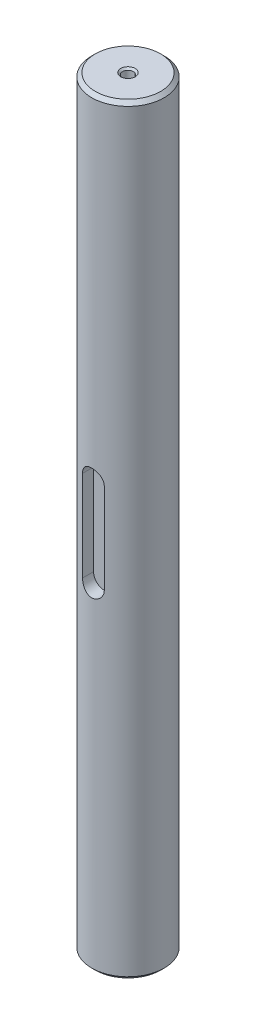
ISO-10303-21;
HEADER;
FILE_DESCRIPTION(('STEP AP214'),'2;1');
FILE_NAME('part.step','',(''),(''),'','','');
FILE_SCHEMA(('AUTOMOTIVE_DESIGN { 1 0 10303 214 1 1 1 1 }'));
ENDSEC;
DATA;
#1=APPLICATION_CONTEXT('core data for automotive mechanical design processes');
#2=APPLICATION_PROTOCOL_DEFINITION('international standard','automotive_design',2000,#1);
#3=PRODUCT_CONTEXT('',#1,'mechanical');
#4=PRODUCT('Part','Part','',(#3));
#5=PRODUCT_RELATED_PRODUCT_CATEGORY('part','',(#4));
#6=PRODUCT_DEFINITION_FORMATION('','',#4);
#7=PRODUCT_DEFINITION_CONTEXT('part definition',#1,'design');
#8=PRODUCT_DEFINITION('design','',#6,#7);
#9=PRODUCT_DEFINITION_SHAPE('','',#8);
#10=(LENGTH_UNIT() NAMED_UNIT(*) SI_UNIT(.MILLI.,.METRE.));
#11=(NAMED_UNIT(*) PLANE_ANGLE_UNIT() SI_UNIT($,.RADIAN.));
#12=(NAMED_UNIT(*) SI_UNIT($,.STERADIAN.) SOLID_ANGLE_UNIT());
#13=UNCERTAINTY_MEASURE_WITH_UNIT(LENGTH_MEASURE(1.E-05),#10,'distance_accuracy_value','');
#14=(GEOMETRIC_REPRESENTATION_CONTEXT(3) GLOBAL_UNCERTAINTY_ASSIGNED_CONTEXT((#13)) GLOBAL_UNIT_ASSIGNED_CONTEXT((#10,
#11,#12)) REPRESENTATION_CONTEXT('',''));
#15=CARTESIAN_POINT('',(0.,0.,0.));
#16=DIRECTION('',(0.,0.,1.));
#17=DIRECTION('',(1.,0.,0.));
#18=AXIS2_PLACEMENT_3D('',#15,#16,#17);
#19=CARTESIAN_POINT('',(0.,105.,0.));
#20=DIRECTION('',(0.,-1.,0.));
#21=DIRECTION('',(0.,0.,-1.));
#22=AXIS2_PLACEMENT_3D('',#19,#20,#21);
#23=CYLINDRICAL_SURFACE('',#22,10.);
#24=CARTESIAN_POINT('',(0.,104.,0.));
#25=DIRECTION('',(0.,1.,0.));
#26=DIRECTION('',(0.,0.,1.));
#27=AXIS2_PLACEMENT_3D('',#24,#25,#26);
#28=CIRCLE('',#27,10.);
#29=CARTESIAN_POINT('',(0.,104.,10.));
#30=VERTEX_POINT('',#29);
#31=EDGE_CURVE('E155',#30,#30,#28,.F.);
#32=ORIENTED_EDGE('',*,*,#31,.T.);
#33=EDGE_LOOP('',(#32));
#34=FACE_BOUND('',#33,.T.);
#35=CARTESIAN_POINT('',(0.,-104.,0.));
#36=DIRECTION('',(0.,1.,0.));
#37=DIRECTION('',(0.,0.,1.));
#38=AXIS2_PLACEMENT_3D('',#35,#36,#37);
#39=CIRCLE('',#38,10.);
#40=CARTESIAN_POINT('',(0.,-104.,10.));
#41=VERTEX_POINT('',#40);
#42=EDGE_CURVE('E152',#41,#41,#39,.T.);
#43=ORIENTED_EDGE('',*,*,#42,.T.);
#44=EDGE_LOOP('',(#43));
#45=FACE_BOUND('',#44,.T.);
#46=CARTESIAN_POINT('',(2.99999999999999,12.5,9.53939201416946));
#47=CARTESIAN_POINT('',(3.00001027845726,12.5823355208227,9.53938054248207));
#48=CARTESIAN_POINT('',(2.99661062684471,12.6646644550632,9.54045772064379));
#49=CARTESIAN_POINT('',(2.98307142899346,12.8286939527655,9.54470412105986));
#50=CARTESIAN_POINT('',(2.97293339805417,12.9103946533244,9.54787287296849));
#51=CARTESIAN_POINT('',(2.94603140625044,13.0723849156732,9.55620668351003));
#52=CARTESIAN_POINT('',(2.92928426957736,13.152677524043,9.56136667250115));
#53=CARTESIAN_POINT('',(2.88932853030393,13.3114758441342,9.57351626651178));
#54=CARTESIAN_POINT('',(2.86611975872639,13.3899815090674,9.58050591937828));
#55=CARTESIAN_POINT('',(2.78708584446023,13.6219493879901,9.60391637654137));
#56=CARTESIAN_POINT('',(2.72181852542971,13.772068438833,9.62279007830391));
#57=CARTESIAN_POINT('',(2.56815043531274,14.059226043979,9.66493213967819));
#58=CARTESIAN_POINT('',(2.47973889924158,14.1962584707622,9.68820254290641));
#59=CARTESIAN_POINT('',(2.27929879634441,14.4577229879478,9.73733650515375));
#60=CARTESIAN_POINT('',(2.16666914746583,14.5816848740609,9.76325505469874));
#61=CARTESIAN_POINT('',(1.92227736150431,14.8092736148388,9.81429628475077));
#62=CARTESIAN_POINT('',(1.79051199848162,14.912897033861,9.8394188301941));
#63=CARTESIAN_POINT('',(1.50821997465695,15.0989268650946,9.88666477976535));
#64=CARTESIAN_POINT('',(1.35736167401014,15.1808501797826,9.90871541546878));
#65=CARTESIAN_POINT('',(1.04324233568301,15.3179770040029,9.94668940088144));
#66=CARTESIAN_POINT('',(0.879984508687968,15.3731874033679,9.96261433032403));
#67=CARTESIAN_POINT('',(0.550649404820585,15.453759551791,9.98615279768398));
#68=CARTESIAN_POINT('',(0.384786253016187,15.4799297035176,9.99399098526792));
#69=CARTESIAN_POINT('',(0.0508471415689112,15.504234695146,10.0012640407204));
#70=CARTESIAN_POINT('',(-0.117228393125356,15.5023748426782,10.0007004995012));
#71=CARTESIAN_POINT('',(-0.445143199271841,15.4712141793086,9.99139205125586));
#72=CARTESIAN_POINT('',(-0.605074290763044,15.4427893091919,9.98290831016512));
#73=CARTESIAN_POINT('',(-0.91778010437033,15.3607367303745,9.95903027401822));
#74=CARTESIAN_POINT('',(-1.0705544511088,15.3071077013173,9.94363561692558));
#75=CARTESIAN_POINT('',(-1.36669563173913,15.1755755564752,9.90730429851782));
#76=CARTESIAN_POINT('',(-1.50993201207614,15.0973967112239,9.88630511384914));
#77=CARTESIAN_POINT('',(-1.78153105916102,14.9192028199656,9.84099249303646));
#78=CARTESIAN_POINT('',(-1.90989038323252,14.8191828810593,9.81667831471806));
#79=CARTESIAN_POINT('',(-2.15330901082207,14.5956160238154,9.7662334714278));
#80=CARTESIAN_POINT('',(-2.26766702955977,14.4713122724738,9.74006890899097));
#81=CARTESIAN_POINT('',(-2.47413538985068,14.2050051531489,9.68968430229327));
#82=CARTESIAN_POINT('',(-2.56623924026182,14.0629966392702,9.66546482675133));
#83=CARTESIAN_POINT('',(-2.72632814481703,13.7634381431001,9.62154457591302));
#84=CARTESIAN_POINT('',(-2.79406012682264,13.6057456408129,9.60189192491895));
#85=CARTESIAN_POINT('',(-2.90171772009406,13.2805509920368,9.56991327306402));
#86=CARTESIAN_POINT('',(-2.94168586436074,13.1130642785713,9.55757606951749));
#87=CARTESIAN_POINT('',(-2.9780240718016,12.8700102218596,9.54628064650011));
#88=CARTESIAN_POINT('',(-2.98626405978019,12.7962185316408,9.54370312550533));
#89=CARTESIAN_POINT('',(-2.9972471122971,12.648297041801,9.54025857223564));
#90=CARTESIAN_POINT('',(-2.99999825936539,12.5741679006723,9.53938902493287));
#91=CARTESIAN_POINT('',(-3.00000000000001,12.5,9.53939201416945));
#92=B_SPLINE_CURVE_WITH_KNOTS('',3,(#46,#47,#48,#49,#50,#51,#52,#53,#54,#55,#56,#57,#58,#59,#60,
#61,#62,#63,#64,#65,#66,#67,#68,#69,#70,#71,#72,#73,#74,#75,#76,#77,#78,#79,#80,#81,#82,#83,#84,
#85,#86,#87,#88,#89,#90,#91),.UNSPECIFIED.,.F.,.F.,(4,2,2,2,2,2,2,2,2,2,2,2,2,2,2,2,2,2,2,2,2,2,
4),(0.,0.246918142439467,0.493780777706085,0.740019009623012,0.986263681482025,1.47813347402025,
1.97023245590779,2.47635119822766,2.98255536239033,3.49922810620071,4.01576751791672,
4.51753600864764,5.01920948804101,5.50490358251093,5.99062312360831,6.48200583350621,
6.9734987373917,7.48389234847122,7.99443465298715,8.51013494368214,9.02504345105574,
9.24774267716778,9.47011372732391),.UNSPECIFIED.);
#93=CARTESIAN_POINT('',(2.99999999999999,12.5,9.53939201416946));
#94=VERTEX_POINT('',#93);
#95=CARTESIAN_POINT('',(-3.00000000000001,12.5,9.53939201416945));
#96=VERTEX_POINT('',#95);
#97=EDGE_CURVE('E107',#94,#96,#92,.T.);
#98=ORIENTED_EDGE('',*,*,#97,.F.);
#99=DIRECTION('',(0.,-1.,0.));
#100=VECTOR('',#99,1.);
#101=CARTESIAN_POINT('',(2.99999999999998,105.,9.53939201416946));
#102=LINE('',#101,#100);
#103=CARTESIAN_POINT('',(2.99999999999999,-12.5,9.53939201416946));
#104=VERTEX_POINT('',#103);
#105=EDGE_CURVE('E146',#104,#94,#102,.F.);
#106=ORIENTED_EDGE('',*,*,#105,.F.);
#107=CARTESIAN_POINT('',(-3.00000000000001,-12.5,9.53939201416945));
#108=CARTESIAN_POINT('',(-3.00001027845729,-12.5823355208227,9.53938054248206));
#109=CARTESIAN_POINT('',(-2.99661062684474,-12.6646644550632,9.54045772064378));
#110=CARTESIAN_POINT('',(-2.98307142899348,-12.8286939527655,9.54470412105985));
#111=CARTESIAN_POINT('',(-2.9729333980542,-12.9103946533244,9.54787287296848));
#112=CARTESIAN_POINT('',(-2.94603140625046,-13.0723849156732,9.55620668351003));
#113=CARTESIAN_POINT('',(-2.92928426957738,-13.152677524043,9.56136667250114));
#114=CARTESIAN_POINT('',(-2.88932853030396,-13.3114758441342,9.57351626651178));
#115=CARTESIAN_POINT('',(-2.86611975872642,-13.3899815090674,9.58050591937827));
#116=CARTESIAN_POINT('',(-2.78708584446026,-13.6219493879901,9.60391637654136));
#117=CARTESIAN_POINT('',(-2.72181852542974,-13.772068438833,9.6227900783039));
#118=CARTESIAN_POINT('',(-2.56815043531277,-14.059226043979,9.66493213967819));
#119=CARTESIAN_POINT('',(-2.47973889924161,-14.1962584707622,9.6882025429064));
#120=CARTESIAN_POINT('',(-2.27929879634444,-14.4577229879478,9.73733650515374));
#121=CARTESIAN_POINT('',(-2.16666914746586,-14.5816848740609,9.76325505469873));
#122=CARTESIAN_POINT('',(-1.92227736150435,-14.8092736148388,9.81429628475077));
#123=CARTESIAN_POINT('',(-1.79051199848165,-14.912897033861,9.8394188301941));
#124=CARTESIAN_POINT('',(-1.50821997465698,-15.0989268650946,9.88666477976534));
#125=CARTESIAN_POINT('',(-1.35736167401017,-15.1808501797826,9.90871541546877));
#126=CARTESIAN_POINT('',(-1.04324233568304,-15.3179770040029,9.94668940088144));
#127=CARTESIAN_POINT('',(-0.879984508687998,-15.3731874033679,9.96261433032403));
#128=CARTESIAN_POINT('',(-0.550649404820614,-15.453759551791,9.98615279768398));
#129=CARTESIAN_POINT('',(-0.384786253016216,-15.4799297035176,9.99399098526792));
#130=CARTESIAN_POINT('',(-0.0508471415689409,-15.504234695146,10.0012640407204));
#131=CARTESIAN_POINT('',(0.117228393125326,-15.5023748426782,10.0007004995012));
#132=CARTESIAN_POINT('',(0.445143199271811,-15.4712141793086,9.99139205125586));
#133=CARTESIAN_POINT('',(0.605074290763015,-15.4427893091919,9.98290831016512));
#134=CARTESIAN_POINT('',(0.9177801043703,-15.3607367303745,9.95903027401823));
#135=CARTESIAN_POINT('',(1.07055445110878,-15.3071077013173,9.94363561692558));
#136=CARTESIAN_POINT('',(1.3666956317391,-15.1755755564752,9.90730429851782));
#137=CARTESIAN_POINT('',(1.50993201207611,-15.0973967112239,9.88630511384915));
#138=CARTESIAN_POINT('',(1.78153105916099,-14.9192028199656,9.84099249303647));
#139=CARTESIAN_POINT('',(1.90989038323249,-14.8191828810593,9.81667831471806));
#140=CARTESIAN_POINT('',(2.15330901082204,-14.5956160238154,9.7662334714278));
#141=CARTESIAN_POINT('',(2.26766702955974,-14.4713122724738,9.74006890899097));
#142=CARTESIAN_POINT('',(2.47413538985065,-14.2050051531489,9.68968430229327));
#143=CARTESIAN_POINT('',(2.56623924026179,-14.0629966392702,9.66546482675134));
#144=CARTESIAN_POINT('',(2.726328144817,-13.7634381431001,9.62154457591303));
#145=CARTESIAN_POINT('',(2.79406012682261,-13.6057456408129,9.60189192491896));
#146=CARTESIAN_POINT('',(2.90171772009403,-13.2805509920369,9.56991327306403));
#147=CARTESIAN_POINT('',(2.94168586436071,-13.1130642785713,9.5575760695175));
#148=CARTESIAN_POINT('',(2.97802407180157,-12.8700102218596,9.54628064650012));
#149=CARTESIAN_POINT('',(2.98626405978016,-12.7962185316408,9.54370312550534));
#150=CARTESIAN_POINT('',(2.99724711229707,-12.648297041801,9.54025857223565));
#151=CARTESIAN_POINT('',(2.99999825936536,-12.5741679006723,9.53938902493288));
#152=CARTESIAN_POINT('',(2.99999999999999,-12.5,9.53939201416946));
#153=B_SPLINE_CURVE_WITH_KNOTS('',3,(#107,#108,#109,#110,#111,#112,#113,#114,#115,#116,#117,
#118,#119,#120,#121,#122,#123,#124,#125,#126,#127,#128,#129,#130,#131,#132,#133,#134,#135,#136,
#137,#138,#139,#140,#141,#142,#143,#144,#145,#146,#147,#148,#149,#150,#151,#152),.UNSPECIFIED.,
.F.,.F.,(4,2,2,2,2,2,2,2,2,2,2,2,2,2,2,2,2,2,2,2,2,2,4),(0.,0.246918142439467,0.493780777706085,
0.740019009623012,0.986263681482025,1.47813347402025,1.97023245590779,2.47635119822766,
2.98255536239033,3.4992281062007,4.01576751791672,4.51753600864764,5.01920948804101,
5.50490358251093,5.99062312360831,6.48200583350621,6.9734987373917,7.48389234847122,
7.99443465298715,8.51013494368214,9.02504345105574,9.24774267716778,9.47011372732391),.UNSPECIFIED.);
#154=CARTESIAN_POINT('',(-3.00000000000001,-12.5,9.53939201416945));
#155=VERTEX_POINT('',#154);
#156=EDGE_CURVE('E65',#155,#104,#153,.T.);
#157=ORIENTED_EDGE('',*,*,#156,.F.);
#158=DIRECTION('',(0.,-1.,0.));
#159=VECTOR('',#158,1.);
#160=CARTESIAN_POINT('',(-3.00000000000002,105.,9.53939201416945));
#161=LINE('',#160,#159);
#162=EDGE_CURVE('E105',#96,#155,#161,.T.);
#163=ORIENTED_EDGE('',*,*,#162,.F.);
#164=EDGE_LOOP('',(#98,#106,#157,#163));
#165=FACE_BOUND('',#164,.T.);
#166=ADVANCED_FACE('F39',(#34,#45,#165),#23,.T.);
#167=CARTESIAN_POINT('',(0.,105.,0.));
#168=DIRECTION('',(0.,1.,0.));
#169=DIRECTION('',(0.,0.,1.));
#170=AXIS2_PLACEMENT_3D('',#167,#168,#169);
#171=PLANE('',#170);
#172=CARTESIAN_POINT('',(0.,105.,0.));
#173=DIRECTION('',(0.,1.,0.));
#174=DIRECTION('',(0.,0.,1.));
#175=AXIS2_PLACEMENT_3D('',#172,#173,#174);
#176=CIRCLE('',#175,1.99999999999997);
#177=CARTESIAN_POINT('',(0.,105.,1.99999999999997));
#178=VERTEX_POINT('',#177);
#179=EDGE_CURVE('E11',#178,#178,#176,.F.);
#180=ORIENTED_EDGE('',*,*,#179,.T.);
#181=EDGE_LOOP('',(#180));
#182=FACE_BOUND('',#181,.T.);
#183=CARTESIAN_POINT('',(0.,105.,0.));
#184=DIRECTION('',(0.,1.,0.));
#185=DIRECTION('',(0.,0.,1.));
#186=AXIS2_PLACEMENT_3D('',#183,#184,#185);
#187=CIRCLE('',#186,9.00000000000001);
#188=CARTESIAN_POINT('',(0.,105.,9.00000000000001));
#189=VERTEX_POINT('',#188);
#190=EDGE_CURVE('E149',#189,#189,#187,.T.);
#191=ORIENTED_EDGE('',*,*,#190,.T.);
#192=EDGE_LOOP('',(#191));
#193=FACE_BOUND('',#192,.T.);
#194=ADVANCED_FACE('F140',(#182,#193),#171,.T.);
#195=CARTESIAN_POINT('',(0.,-105.,0.));
#196=DIRECTION('',(0.,1.,0.));
#197=DIRECTION('',(0.,0.,1.));
#198=AXIS2_PLACEMENT_3D('',#195,#196,#197);
#199=PLANE('',#198);
#200=CARTESIAN_POINT('',(0.,-105.,0.));
#201=DIRECTION('',(0.,1.,0.));
#202=DIRECTION('',(0.,0.,1.));
#203=AXIS2_PLACEMENT_3D('',#200,#201,#202);
#204=CIRCLE('',#203,1.99999999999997);
#205=CARTESIAN_POINT('',(0.,-105.,1.99999999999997));
#206=VERTEX_POINT('',#205);
#207=EDGE_CURVE('E47',#206,#206,#204,.T.);
#208=ORIENTED_EDGE('',*,*,#207,.T.);
#209=EDGE_LOOP('',(#208));
#210=FACE_BOUND('',#209,.T.);
#211=CARTESIAN_POINT('',(0.,-105.,0.));
#212=DIRECTION('',(0.,1.,0.));
#213=DIRECTION('',(0.,0.,1.));
#214=AXIS2_PLACEMENT_3D('',#211,#212,#213);
#215=CIRCLE('',#214,8.99999999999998);
#216=CARTESIAN_POINT('',(0.,-105.,8.99999999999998));
#217=VERTEX_POINT('',#216);
#218=EDGE_CURVE('E158',#217,#217,#215,.F.);
#219=ORIENTED_EDGE('',*,*,#218,.T.);
#220=EDGE_LOOP('',(#219));
#221=FACE_BOUND('',#220,.T.);
#222=ADVANCED_FACE('F139',(#210,#221),#199,.F.);
#223=CARTESIAN_POINT('',(0.,-12.5,6.50000000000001));
#224=DIRECTION('',(0.,0.,1.));
#225=DIRECTION('',(1.,0.,0.));
#226=AXIS2_PLACEMENT_3D('',#223,#224,#225);
#227=CYLINDRICAL_SURFACE('',#226,3.);
#228=DIRECTION('',(0.,0.,1.));
#229=VECTOR('',#228,1.);
#230=CARTESIAN_POINT('',(-3.00000000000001,-12.5,6.5));
#231=LINE('',#230,#229);
#232=CARTESIAN_POINT('',(-3.00000000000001,-12.5,6.5));
#233=VERTEX_POINT('',#232);
#234=EDGE_CURVE('E101',#233,#155,#231,.T.);
#235=ORIENTED_EDGE('',*,*,#234,.T.);
#236=ORIENTED_EDGE('',*,*,#156,.T.);
#237=DIRECTION('',(0.,0.,1.));
#238=VECTOR('',#237,1.);
#239=CARTESIAN_POINT('',(2.99999999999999,-12.5,6.50000000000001));
#240=LINE('',#239,#238);
#241=CARTESIAN_POINT('',(2.99999999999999,-12.5,6.50000000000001));
#242=VERTEX_POINT('',#241);
#243=EDGE_CURVE('E56',#242,#104,#240,.T.);
#244=ORIENTED_EDGE('',*,*,#243,.F.);
#245=CARTESIAN_POINT('',(0.,-12.5,6.50000000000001));
#246=DIRECTION('',(0.,0.,-1.));
#247=DIRECTION('',(1.,0.,0.));
#248=AXIS2_PLACEMENT_3D('',#245,#246,#247);
#249=CIRCLE('',#248,3.);
#250=EDGE_CURVE('E90',#242,#233,#249,.T.);
#251=ORIENTED_EDGE('',*,*,#250,.T.);
#252=EDGE_LOOP('',(#235,#236,#244,#251));
#253=FACE_BOUND('',#252,.T.);
#254=ADVANCED_FACE('F100',(#253),#227,.F.);
#255=CARTESIAN_POINT('',(-3.00000000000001,-12.5,6.5));
#256=DIRECTION('',(1.,0.,0.));
#257=DIRECTION('',(0.,0.,-1.));
#258=AXIS2_PLACEMENT_3D('',#255,#256,#257);
#259=PLANE('',#258);
#260=ORIENTED_EDGE('',*,*,#162,.T.);
#261=ORIENTED_EDGE('',*,*,#234,.F.);
#262=DIRECTION('',(0.,1.,0.));
#263=VECTOR('',#262,1.);
#264=CARTESIAN_POINT('',(-3.00000000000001,-12.5,6.5));
#265=LINE('',#264,#263);
#266=CARTESIAN_POINT('',(-3.00000000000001,12.5,6.50000000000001));
#267=VERTEX_POINT('',#266);
#268=EDGE_CURVE('E86',#233,#267,#265,.T.);
#269=ORIENTED_EDGE('',*,*,#268,.T.);
#270=DIRECTION('',(0.,0.,1.));
#271=VECTOR('',#270,1.);
#272=CARTESIAN_POINT('',(-3.00000000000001,12.5,6.50000000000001));
#273=LINE('',#272,#271);
#274=EDGE_CURVE('E108',#267,#96,#273,.T.);
#275=ORIENTED_EDGE('',*,*,#274,.T.);
#276=EDGE_LOOP('',(#260,#261,#269,#275));
#277=FACE_BOUND('',#276,.T.);
#278=ADVANCED_FACE('F104',(#277),#259,.T.);
#279=CARTESIAN_POINT('',(0.,12.5,6.50000000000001));
#280=DIRECTION('',(0.,0.,1.));
#281=DIRECTION('',(1.,0.,0.));
#282=AXIS2_PLACEMENT_3D('',#279,#280,#281);
#283=CYLINDRICAL_SURFACE('',#282,3.);
#284=DIRECTION('',(0.,0.,1.));
#285=VECTOR('',#284,1.);
#286=CARTESIAN_POINT('',(2.99999999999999,12.5,6.50000000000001));
#287=LINE('',#286,#285);
#288=CARTESIAN_POINT('',(2.99999999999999,12.5,6.50000000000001));
#289=VERTEX_POINT('',#288);
#290=EDGE_CURVE('E113',#289,#94,#287,.T.);
#291=ORIENTED_EDGE('',*,*,#290,.T.);
#292=ORIENTED_EDGE('',*,*,#97,.T.);
#293=ORIENTED_EDGE('',*,*,#274,.F.);
#294=CARTESIAN_POINT('',(0.,12.5,6.50000000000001));
#295=DIRECTION('',(0.,0.,-1.));
#296=DIRECTION('',(-1.,0.,0.));
#297=AXIS2_PLACEMENT_3D('',#294,#295,#296);
#298=CIRCLE('',#297,3.);
#299=EDGE_CURVE('E91',#267,#289,#298,.T.);
#300=ORIENTED_EDGE('',*,*,#299,.T.);
#301=EDGE_LOOP('',(#291,#292,#293,#300));
#302=FACE_BOUND('',#301,.T.);
#303=ADVANCED_FACE('F126',(#302),#283,.F.);
#304=CARTESIAN_POINT('',(2.99999999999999,-12.5,6.50000000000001));
#305=DIRECTION('',(-1.,0.,0.));
#306=DIRECTION('',(0.,0.,1.));
#307=AXIS2_PLACEMENT_3D('',#304,#305,#306);
#308=PLANE('',#307);
#309=ORIENTED_EDGE('',*,*,#105,.T.);
#310=ORIENTED_EDGE('',*,*,#290,.F.);
#311=DIRECTION('',(0.,-1.,0.));
#312=VECTOR('',#311,1.);
#313=CARTESIAN_POINT('',(2.99999999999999,-12.5,6.50000000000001));
#314=LINE('',#313,#312);
#315=EDGE_CURVE('E210',#289,#242,#314,.T.);
#316=ORIENTED_EDGE('',*,*,#315,.T.);
#317=ORIENTED_EDGE('',*,*,#243,.T.);
#318=EDGE_LOOP('',(#309,#310,#316,#317));
#319=FACE_BOUND('',#318,.T.);
#320=ADVANCED_FACE('F131',(#319),#308,.T.);
#321=CARTESIAN_POINT('',(0.,-12.5,6.50000000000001));
#322=DIRECTION('',(0.,0.,1.));
#323=DIRECTION('',(1.,0.,0.));
#324=AXIS2_PLACEMENT_3D('',#321,#322,#323);
#325=PLANE('',#324);
#326=ORIENTED_EDGE('',*,*,#250,.F.);
#327=ORIENTED_EDGE('',*,*,#315,.F.);
#328=ORIENTED_EDGE('',*,*,#299,.F.);
#329=ORIENTED_EDGE('',*,*,#268,.F.);
#330=EDGE_LOOP('',(#326,#327,#328,#329));
#331=FACE_BOUND('',#330,.T.);
#332=ADVANCED_FACE('F88',(#331),#325,.T.);
#333=CARTESIAN_POINT('',(0.,105.,0.));
#334=DIRECTION('',(0.,-1.,0.));
#335=DIRECTION('',(0.,0.,-1.));
#336=AXIS2_PLACEMENT_3D('',#333,#334,#335);
#337=CONICAL_SURFACE('',#336,9.00000000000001,0.785398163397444);
#338=ORIENTED_EDGE('',*,*,#31,.F.);
#339=EDGE_LOOP('',(#338));
#340=FACE_BOUND('',#339,.T.);
#341=ORIENTED_EDGE('',*,*,#190,.F.);
#342=EDGE_LOOP('',(#341));
#343=FACE_BOUND('',#342,.T.);
#344=ADVANCED_FACE('F191',(#340,#343),#337,.T.);
#345=CARTESIAN_POINT('',(0.,-104.,0.));
#346=DIRECTION('',(0.,1.,0.));
#347=DIRECTION('',(0.,0.,1.));
#348=AXIS2_PLACEMENT_3D('',#345,#346,#347);
#349=CONICAL_SURFACE('',#348,10.,0.785398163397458);
#350=ORIENTED_EDGE('',*,*,#218,.F.);
#351=EDGE_LOOP('',(#350));
#352=FACE_BOUND('',#351,.T.);
#353=ORIENTED_EDGE('',*,*,#42,.F.);
#354=EDGE_LOOP('',(#353));
#355=FACE_BOUND('',#354,.T.);
#356=ADVANCED_FACE('F179',(#352,#355),#349,.T.);
#357=CARTESIAN_POINT('',(0.,105.,0.));
#358=DIRECTION('',(0.,-1.,0.));
#359=DIRECTION('',(0.,0.,-1.));
#360=AXIS2_PLACEMENT_3D('',#357,#358,#359);
#361=CYLINDRICAL_SURFACE('',#360,1.5);
#362=CARTESIAN_POINT('',(0.,-104.5,0.));
#363=DIRECTION('',(0.,1.,0.));
#364=DIRECTION('',(0.,0.,1.));
#365=AXIS2_PLACEMENT_3D('',#362,#363,#364);
#366=CIRCLE('',#365,1.5);
#367=CARTESIAN_POINT('',(0.,-104.5,1.5));
#368=VERTEX_POINT('',#367);
#369=EDGE_CURVE('E164',#368,#368,#366,.F.);
#370=ORIENTED_EDGE('',*,*,#369,.T.);
#371=EDGE_LOOP('',(#370));
#372=FACE_BOUND('',#371,.T.);
#373=CARTESIAN_POINT('',(0.,104.5,0.));
#374=DIRECTION('',(0.,1.,0.));
#375=DIRECTION('',(0.,0.,1.));
#376=AXIS2_PLACEMENT_3D('',#373,#374,#375);
#377=CIRCLE('',#376,1.5);
#378=CARTESIAN_POINT('',(0.,104.5,1.5));
#379=VERTEX_POINT('',#378);
#380=EDGE_CURVE('E161',#379,#379,#377,.T.);
#381=ORIENTED_EDGE('',*,*,#380,.T.);
#382=EDGE_LOOP('',(#381));
#383=FACE_BOUND('',#382,.T.);
#384=ADVANCED_FACE('F174',(#372,#383),#361,.F.);
#385=CARTESIAN_POINT('',(0.,-104.5,0.));
#386=DIRECTION('',(0.,-1.,0.));
#387=DIRECTION('',(0.,0.,-1.));
#388=AXIS2_PLACEMENT_3D('',#385,#386,#387);
#389=CONICAL_SURFACE('',#388,1.5,0.785398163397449);
#390=ORIENTED_EDGE('',*,*,#207,.F.);
#391=EDGE_LOOP('',(#390));
#392=FACE_BOUND('',#391,.T.);
#393=ORIENTED_EDGE('',*,*,#369,.F.);
#394=EDGE_LOOP('',(#393));
#395=FACE_BOUND('',#394,.T.);
#396=ADVANCED_FACE('F171',(#392,#395),#389,.F.);
#397=CARTESIAN_POINT('',(0.,105.,0.));
#398=DIRECTION('',(0.,1.,0.));
#399=DIRECTION('',(0.,0.,1.));
#400=AXIS2_PLACEMENT_3D('',#397,#398,#399);
#401=CONICAL_SURFACE('',#400,1.99999999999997,0.785398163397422);
#402=ORIENTED_EDGE('',*,*,#380,.F.);
#403=EDGE_LOOP('',(#402));
#404=FACE_BOUND('',#403,.T.);
#405=ORIENTED_EDGE('',*,*,#179,.F.);
#406=EDGE_LOOP('',(#405));
#407=FACE_BOUND('',#406,.T.);
#408=ADVANCED_FACE('F41',(#404,#407),#401,.F.);
#409=CLOSED_SHELL('',(#166,#194,#222,#254,#278,#303,#320,#332,#344,#356,#384,#396,#408));
#410=MANIFOLD_SOLID_BREP('B2',#409);
#411=ADVANCED_BREP_SHAPE_REPRESENTATION('',(#18,#410),#14);
#412=SHAPE_DEFINITION_REPRESENTATION(#9,#411);
ENDSEC;
END-ISO-10303-21;
